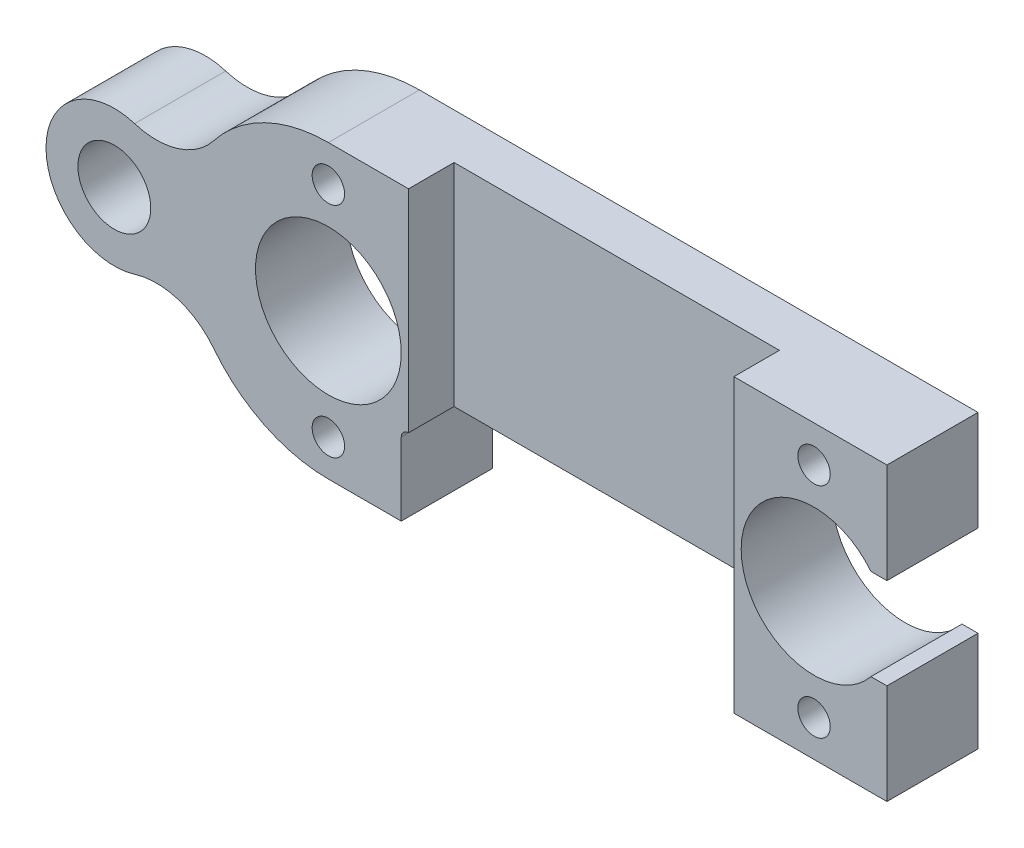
from build123d import *

# Parameters (mm, degrees)
SKETCH1_R             = 5.08
SKETCH1_R_2           = 2.54
BOSS_EXTRUDE1_DEPTH   = 6.35
F_4_40_TAPPED_HOLE1_D = 2.2606
FILLET1_R             = 0.508
SKETCH6_W             = 22.6822
SKETCH6_H             = 20.32
CUT_EXTRUDE2_DEPTH    = 3.175


with BuildPart() as part:
    # Sketch1 → Boss-Extrude1 (new body)
    with BuildSketch(Plane.XY):
        with BuildLine():
            Line((24.332993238, 15.544661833), (-14.605206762, 15.544661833))
            ThreePointArc((-14.605206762, 15.544661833), (-19.05330112, 14.519214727), (-22.603504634, 11.649869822))
            ThreePointArc((-22.603504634, 11.649869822), (-25.090333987, 9.932804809), (-28.112358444, 9.931990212))
            ThreePointArc((-28.112358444, 9.931990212), (-34.290206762, 5.384661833), (-28.112358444, 0.837333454))
            ThreePointArc((-28.112358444, 0.837333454), (-25.090333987, 0.836518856), (-22.603504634, -0.880546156))
            ThreePointArc((-22.603504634, -0.880546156), (-19.05330112, -3.749891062), (-14.605206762, -4.775338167))
            Line((-14.605206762, -4.775338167), (-9.525206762, -4.775338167))
            Line((-9.525206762, -4.775338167), (-9.525206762, 0.812661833))
            Line((-9.525206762, 0.812661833), (13.664993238, 0.812661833))
            Line((13.664993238, 0.812661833), (13.664993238, -4.775338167))
            Line((13.664993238, -4.775338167), (24.332993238, -4.775338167))
            Line((24.332993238, -4.775338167), (24.332993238, 2.209661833))
            Line((24.332993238, 2.209661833), (23.218566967, 2.209661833))
            ThreePointArc((23.218566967, 2.209661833), (14.172993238, 5.384661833), (23.218566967, 8.559661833))
            Line((23.218566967, 8.559661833), (24.332993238, 8.559661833))
            Line((24.332993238, 8.559661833), (24.332993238, 15.544661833))
        make_face()
        with Locations((-14.605206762, 5.384661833)):
            Circle(SKETCH1_R, mode=Mode.SUBTRACT)
        with Locations((-29.527706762, 5.384661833)):
            Circle(SKETCH1_R_2, mode=Mode.SUBTRACT)
    extrude(amount=BOSS_EXTRUDE1_DEPTH)

    # 4-40 Tapped Hole1 (through all)
    with Locations(Plane.XY.offset(6.35)):
        with Locations((19.252993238, -2.235338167), (19.252993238, 13.004661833), (-14.605206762, 13.004661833), (-14.605206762, -2.235338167)):
            Hole(F_4_40_TAPPED_HOLE1_D / 2)

    # Fillet1
    fillet1_edges = [part.edges().sort_by_distance(p)[0] for p in [
        (13.664993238, 0.812661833, 3.175),
        (-9.525206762, 0.812661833, 3.175),
    ]]
    fillet(fillet1_edges, radius=FILLET1_R)

    # Sketch6 → Cut-Extrude2 (cut)
    with BuildSketch(Plane.XY.offset(6.35)):
        with Locations((2.323893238, 5.384661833)):
            Rectangle(SKETCH6_W, SKETCH6_H)
    extrude(amount=-CUT_EXTRUDE2_DEPTH, mode=Mode.SUBTRACT)


solid = part.part
